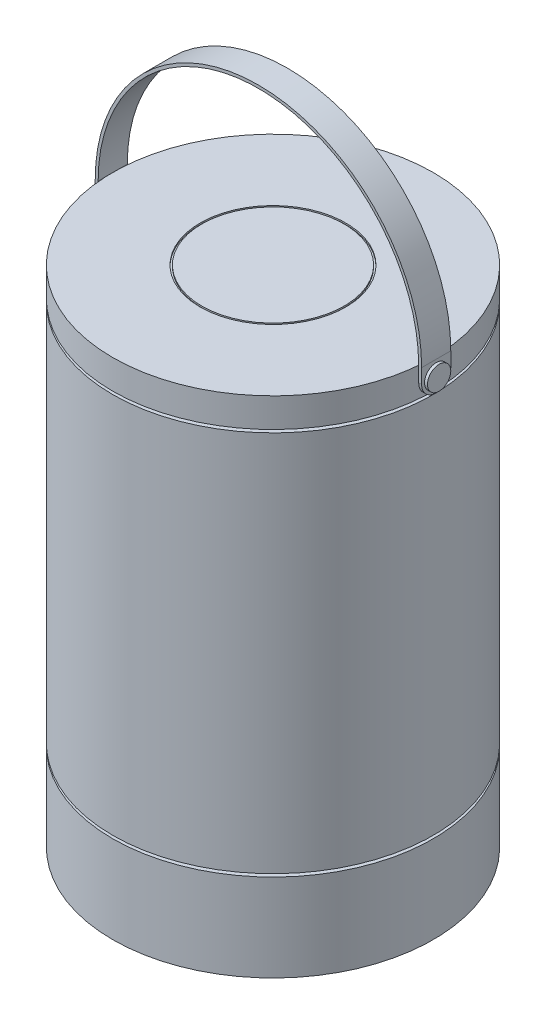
ISO-10303-21;
HEADER;
FILE_DESCRIPTION(('STEP AP214'),'2;1');
FILE_NAME('part.step','',(''),(''),'','','');
FILE_SCHEMA(('AUTOMOTIVE_DESIGN { 1 0 10303 214 1 1 1 1 }'));
ENDSEC;
DATA;
#1=APPLICATION_CONTEXT('core data for automotive mechanical design processes');
#2=APPLICATION_PROTOCOL_DEFINITION('international standard','automotive_design',2000,#1);
#3=PRODUCT_CONTEXT('',#1,'mechanical');
#4=PRODUCT('Part','Part','',(#3));
#5=PRODUCT_RELATED_PRODUCT_CATEGORY('part','',(#4));
#6=PRODUCT_DEFINITION_FORMATION('','',#4);
#7=PRODUCT_DEFINITION_CONTEXT('part definition',#1,'design');
#8=PRODUCT_DEFINITION('design','',#6,#7);
#9=PRODUCT_DEFINITION_SHAPE('','',#8);
#10=(LENGTH_UNIT() NAMED_UNIT(*) SI_UNIT(.MILLI.,.METRE.));
#11=(NAMED_UNIT(*) PLANE_ANGLE_UNIT() SI_UNIT($,.RADIAN.));
#12=(NAMED_UNIT(*) SI_UNIT($,.STERADIAN.) SOLID_ANGLE_UNIT());
#13=UNCERTAINTY_MEASURE_WITH_UNIT(LENGTH_MEASURE(1.E-05),#10,'distance_accuracy_value','');
#14=(GEOMETRIC_REPRESENTATION_CONTEXT(3) GLOBAL_UNCERTAINTY_ASSIGNED_CONTEXT((#13)) GLOBAL_UNIT_ASSIGNED_CONTEXT((#10,
#11,#12)) REPRESENTATION_CONTEXT('',''));
#15=CARTESIAN_POINT('',(0.,0.,0.));
#16=DIRECTION('',(0.,0.,1.));
#17=DIRECTION('',(1.,0.,0.));
#18=AXIS2_PLACEMENT_3D('',#15,#16,#17);
#19=CARTESIAN_POINT('',(55.,168.,0.));
#20=DIRECTION('',(1.,0.,0.));
#21=DIRECTION('',(0.,0.,-1.));
#22=AXIS2_PLACEMENT_3D('',#19,#20,#21);
#23=CYLINDRICAL_SURFACE('',#22,5.);
#24=DIRECTION('',(1.,0.,0.));
#25=VECTOR('',#24,1.);
#26=CARTESIAN_POINT('',(0.,168.,5.));
#27=LINE('',#26,#25);
#28=CARTESIAN_POINT('',(55.,168.,5.));
#29=VERTEX_POINT('',#28);
#30=CARTESIAN_POINT('',(56.,168.,5.));
#31=VERTEX_POINT('',#30);
#32=EDGE_CURVE('E183',#29,#31,#27,.T.);
#33=ORIENTED_EDGE('',*,*,#32,.F.);
#34=CARTESIAN_POINT('',(55.,168.,0.));
#35=DIRECTION('',(-1.,0.,0.));
#36=DIRECTION('',(0.,0.,1.));
#37=AXIS2_PLACEMENT_3D('',#34,#35,#36);
#38=CIRCLE('',#37,5.);
#39=CARTESIAN_POINT('',(55.,168.,-5.));
#40=VERTEX_POINT('',#39);
#41=EDGE_CURVE('E66',#40,#29,#38,.T.);
#42=ORIENTED_EDGE('',*,*,#41,.F.);
#43=DIRECTION('',(-1.,0.,0.));
#44=VECTOR('',#43,1.);
#45=CARTESIAN_POINT('',(55.,168.,-5.));
#46=LINE('',#45,#44);
#47=CARTESIAN_POINT('',(56.,168.,-5.));
#48=VERTEX_POINT('',#47);
#49=EDGE_CURVE('E185',#48,#40,#46,.T.);
#50=ORIENTED_EDGE('',*,*,#49,.F.);
#51=CARTESIAN_POINT('',(56.,168.,0.));
#52=DIRECTION('',(1.,0.,0.));
#53=DIRECTION('',(0.,0.,-1.));
#54=AXIS2_PLACEMENT_3D('',#51,#52,#53);
#55=CIRCLE('',#54,5.);
#56=EDGE_CURVE('E59',#31,#48,#55,.T.);
#57=ORIENTED_EDGE('',*,*,#56,.F.);
#58=EDGE_LOOP('',(#33,#42,#50,#57));
#59=FACE_BOUND('',#58,.T.);
#60=ADVANCED_FACE('F51',(#59),#23,.T.);
#61=CARTESIAN_POINT('',(-55.,168.,0.));
#62=DIRECTION('',(1.,0.,0.));
#63=DIRECTION('',(0.,0.,-1.));
#64=AXIS2_PLACEMENT_3D('',#61,#62,#63);
#65=CYLINDRICAL_SURFACE('',#64,5.);
#66=DIRECTION('',(-1.,0.,0.));
#67=VECTOR('',#66,1.);
#68=CARTESIAN_POINT('',(-55.,168.,-5.));
#69=LINE('',#68,#67);
#70=CARTESIAN_POINT('',(-55.,168.,-5.));
#71=VERTEX_POINT('',#70);
#72=CARTESIAN_POINT('',(-56.,168.,-5.));
#73=VERTEX_POINT('',#72);
#74=EDGE_CURVE('E171',#71,#73,#69,.T.);
#75=ORIENTED_EDGE('',*,*,#74,.F.);
#76=CARTESIAN_POINT('',(-55.,168.,0.));
#77=DIRECTION('',(1.,0.,0.));
#78=DIRECTION('',(0.,0.,-1.));
#79=AXIS2_PLACEMENT_3D('',#76,#77,#78);
#80=CIRCLE('',#79,5.);
#81=CARTESIAN_POINT('',(-55.,168.,5.));
#82=VERTEX_POINT('',#81);
#83=EDGE_CURVE('E180',#82,#71,#80,.T.);
#84=ORIENTED_EDGE('',*,*,#83,.F.);
#85=DIRECTION('',(1.,0.,0.));
#86=VECTOR('',#85,1.);
#87=CARTESIAN_POINT('',(0.,168.,5.));
#88=LINE('',#87,#86);
#89=CARTESIAN_POINT('',(-56.,168.,5.));
#90=VERTEX_POINT('',#89);
#91=EDGE_CURVE('E178',#90,#82,#88,.T.);
#92=ORIENTED_EDGE('',*,*,#91,.F.);
#93=CARTESIAN_POINT('',(-56.,168.,0.));
#94=DIRECTION('',(-1.,0.,0.));
#95=DIRECTION('',(0.,0.,1.));
#96=AXIS2_PLACEMENT_3D('',#93,#94,#95);
#97=CIRCLE('',#96,5.);
#98=EDGE_CURVE('E132',#73,#90,#97,.T.);
#99=ORIENTED_EDGE('',*,*,#98,.F.);
#100=EDGE_LOOP('',(#75,#84,#92,#99));
#101=FACE_BOUND('',#100,.T.);
#102=ADVANCED_FACE('F210',(#101),#65,.T.);
#103=CARTESIAN_POINT('',(0.,173.,-5.));
#104=DIRECTION('',(0.,0.,1.));
#105=DIRECTION('',(1.,0.,0.));
#106=AXIS2_PLACEMENT_3D('',#103,#104,#105);
#107=CYLINDRICAL_SURFACE('',#106,56.);
#108=DIRECTION('',(0.,0.,1.));
#109=VECTOR('',#108,1.);
#110=CARTESIAN_POINT('',(-56.,173.,-5.));
#111=LINE('',#110,#109);
#112=CARTESIAN_POINT('',(-56.,173.,-5.));
#113=VERTEX_POINT('',#112);
#114=CARTESIAN_POINT('',(-56.,173.,5.));
#115=VERTEX_POINT('',#114);
#116=EDGE_CURVE('E115',#113,#115,#111,.T.);
#117=ORIENTED_EDGE('',*,*,#116,.T.);
#118=CARTESIAN_POINT('',(0.,173.,5.));
#119=DIRECTION('',(0.,0.,1.));
#120=DIRECTION('',(1.,0.,0.));
#121=AXIS2_PLACEMENT_3D('',#118,#119,#120);
#122=CIRCLE('',#121,56.);
#123=CARTESIAN_POINT('',(56.,173.,5.));
#124=VERTEX_POINT('',#123);
#125=EDGE_CURVE('E120',#124,#115,#122,.T.);
#126=ORIENTED_EDGE('',*,*,#125,.F.);
#127=DIRECTION('',(0.,0.,1.));
#128=VECTOR('',#127,1.);
#129=CARTESIAN_POINT('',(56.,173.,-5.));
#130=LINE('',#129,#128);
#131=CARTESIAN_POINT('',(56.,173.,-5.));
#132=VERTEX_POINT('',#131);
#133=EDGE_CURVE('E169',#132,#124,#130,.T.);
#134=ORIENTED_EDGE('',*,*,#133,.F.);
#135=CARTESIAN_POINT('',(0.,173.,-5.));
#136=DIRECTION('',(0.,0.,1.));
#137=DIRECTION('',(1.,0.,0.));
#138=AXIS2_PLACEMENT_3D('',#135,#136,#137);
#139=CIRCLE('',#138,56.);
#140=EDGE_CURVE('E122',#132,#113,#139,.T.);
#141=ORIENTED_EDGE('',*,*,#140,.T.);
#142=EDGE_LOOP('',(#117,#126,#134,#141));
#143=FACE_BOUND('',#142,.T.);
#144=ADVANCED_FACE('F117',(#143),#107,.T.);
#145=CARTESIAN_POINT('',(56.,173.,-5.));
#146=DIRECTION('',(1.,0.,0.));
#147=DIRECTION('',(0.,0.,-1.));
#148=AXIS2_PLACEMENT_3D('',#145,#146,#147);
#149=PLANE('',#148);
#150=CARTESIAN_POINT('',(56.,168.,0.));
#151=DIRECTION('',(1.,0.,0.));
#152=DIRECTION('',(0.,0.,-1.));
#153=AXIS2_PLACEMENT_3D('',#150,#151,#152);
#154=CIRCLE('',#153,4.);
#155=CARTESIAN_POINT('',(56.,168.,-4.));
#156=VERTEX_POINT('',#155);
#157=EDGE_CURVE('E146',#156,#156,#154,.T.);
#158=ORIENTED_EDGE('',*,*,#157,.F.);
#159=EDGE_LOOP('',(#158));
#160=FACE_BOUND('',#159,.T.);
#161=DIRECTION('',(0.,1.,0.));
#162=VECTOR('',#161,1.);
#163=CARTESIAN_POINT('',(56.,173.,5.));
#164=LINE('',#163,#162);
#165=EDGE_CURVE('E141',#31,#124,#164,.T.);
#166=ORIENTED_EDGE('',*,*,#165,.F.);
#167=ORIENTED_EDGE('',*,*,#56,.T.);
#168=DIRECTION('',(0.,1.,0.));
#169=VECTOR('',#168,1.);
#170=CARTESIAN_POINT('',(56.,173.,-5.));
#171=LINE('',#170,#169);
#172=EDGE_CURVE('E127',#48,#132,#171,.T.);
#173=ORIENTED_EDGE('',*,*,#172,.T.);
#174=ORIENTED_EDGE('',*,*,#133,.T.);
#175=EDGE_LOOP('',(#166,#167,#173,#174));
#176=FACE_BOUND('',#175,.T.);
#177=ADVANCED_FACE('F201',(#160,#176),#149,.T.);
#178=CARTESIAN_POINT('',(55.,173.,-5.));
#179=DIRECTION('',(-1.,0.,0.));
#180=DIRECTION('',(0.,0.,1.));
#181=AXIS2_PLACEMENT_3D('',#178,#179,#180);
#182=PLANE('',#181);
#183=DIRECTION('',(0.,-1.,0.));
#184=VECTOR('',#183,1.);
#185=CARTESIAN_POINT('',(55.,173.,-5.));
#186=LINE('',#185,#184);
#187=CARTESIAN_POINT('',(55.,173.,-5.));
#188=VERTEX_POINT('',#187);
#189=EDGE_CURVE('E165',#188,#40,#186,.T.);
#190=ORIENTED_EDGE('',*,*,#189,.T.);
#191=ORIENTED_EDGE('',*,*,#41,.T.);
#192=DIRECTION('',(0.,-1.,0.));
#193=VECTOR('',#192,1.);
#194=CARTESIAN_POINT('',(55.,173.,5.));
#195=LINE('',#194,#193);
#196=CARTESIAN_POINT('',(55.,173.,5.));
#197=VERTEX_POINT('',#196);
#198=EDGE_CURVE('E154',#197,#29,#195,.T.);
#199=ORIENTED_EDGE('',*,*,#198,.F.);
#200=DIRECTION('',(0.,0.,1.));
#201=VECTOR('',#200,1.);
#202=CARTESIAN_POINT('',(55.,173.,-5.));
#203=LINE('',#202,#201);
#204=EDGE_CURVE('E172',#188,#197,#203,.T.);
#205=ORIENTED_EDGE('',*,*,#204,.F.);
#206=EDGE_LOOP('',(#190,#191,#199,#205));
#207=FACE_BOUND('',#206,.T.);
#208=ADVANCED_FACE('F189',(#207),#182,.T.);
#209=CARTESIAN_POINT('',(0.,173.,-5.));
#210=DIRECTION('',(0.,0.,1.));
#211=DIRECTION('',(1.,0.,0.));
#212=AXIS2_PLACEMENT_3D('',#209,#210,#211);
#213=CYLINDRICAL_SURFACE('',#212,55.);
#214=ORIENTED_EDGE('',*,*,#204,.T.);
#215=CARTESIAN_POINT('',(0.,173.,5.));
#216=DIRECTION('',(0.,0.,-1.));
#217=DIRECTION('',(1.,0.,0.));
#218=AXIS2_PLACEMENT_3D('',#215,#216,#217);
#219=CIRCLE('',#218,55.);
#220=CARTESIAN_POINT('',(-55.,173.,5.));
#221=VERTEX_POINT('',#220);
#222=EDGE_CURVE('E151',#221,#197,#219,.T.);
#223=ORIENTED_EDGE('',*,*,#222,.F.);
#224=DIRECTION('',(0.,0.,1.));
#225=VECTOR('',#224,1.);
#226=CARTESIAN_POINT('',(-55.,173.,-5.));
#227=LINE('',#226,#225);
#228=CARTESIAN_POINT('',(-55.,173.,-5.));
#229=VERTEX_POINT('',#228);
#230=EDGE_CURVE('E126',#229,#221,#227,.T.);
#231=ORIENTED_EDGE('',*,*,#230,.F.);
#232=CARTESIAN_POINT('',(0.,173.,-5.));
#233=DIRECTION('',(0.,0.,-1.));
#234=DIRECTION('',(1.,0.,0.));
#235=AXIS2_PLACEMENT_3D('',#232,#233,#234);
#236=CIRCLE('',#235,55.);
#237=EDGE_CURVE('E162',#229,#188,#236,.T.);
#238=ORIENTED_EDGE('',*,*,#237,.T.);
#239=EDGE_LOOP('',(#214,#223,#231,#238));
#240=FACE_BOUND('',#239,.T.);
#241=ADVANCED_FACE('F195',(#240),#213,.F.);
#242=CARTESIAN_POINT('',(-55.,173.,-5.));
#243=DIRECTION('',(1.,0.,0.));
#244=DIRECTION('',(0.,0.,-1.));
#245=AXIS2_PLACEMENT_3D('',#242,#243,#244);
#246=PLANE('',#245);
#247=DIRECTION('',(0.,1.,0.));
#248=VECTOR('',#247,1.);
#249=CARTESIAN_POINT('',(-55.,173.,5.));
#250=LINE('',#249,#248);
#251=EDGE_CURVE('E136',#82,#221,#250,.T.);
#252=ORIENTED_EDGE('',*,*,#251,.F.);
#253=ORIENTED_EDGE('',*,*,#83,.T.);
#254=DIRECTION('',(0.,1.,0.));
#255=VECTOR('',#254,1.);
#256=CARTESIAN_POINT('',(-55.,173.,-5.));
#257=LINE('',#256,#255);
#258=EDGE_CURVE('E160',#71,#229,#257,.T.);
#259=ORIENTED_EDGE('',*,*,#258,.T.);
#260=ORIENTED_EDGE('',*,*,#230,.T.);
#261=EDGE_LOOP('',(#252,#253,#259,#260));
#262=FACE_BOUND('',#261,.T.);
#263=ADVANCED_FACE('F228',(#262),#246,.T.);
#264=CARTESIAN_POINT('',(-56.,173.,-5.));
#265=DIRECTION('',(-1.,0.,0.));
#266=DIRECTION('',(0.,0.,1.));
#267=AXIS2_PLACEMENT_3D('',#264,#265,#266);
#268=PLANE('',#267);
#269=CARTESIAN_POINT('',(-56.,168.,0.));
#270=DIRECTION('',(-1.,0.,0.));
#271=DIRECTION('',(0.,0.,1.));
#272=AXIS2_PLACEMENT_3D('',#269,#270,#271);
#273=CIRCLE('',#272,4.);
#274=CARTESIAN_POINT('',(-56.,168.,4.));
#275=VERTEX_POINT('',#274);
#276=EDGE_CURVE('E12',#275,#275,#273,.T.);
#277=ORIENTED_EDGE('',*,*,#276,.F.);
#278=EDGE_LOOP('',(#277));
#279=FACE_BOUND('',#278,.T.);
#280=DIRECTION('',(0.,-1.,0.));
#281=VECTOR('',#280,1.);
#282=CARTESIAN_POINT('',(-56.,173.,-5.));
#283=LINE('',#282,#281);
#284=EDGE_CURVE('E158',#113,#73,#283,.T.);
#285=ORIENTED_EDGE('',*,*,#284,.T.);
#286=ORIENTED_EDGE('',*,*,#98,.T.);
#287=DIRECTION('',(0.,-1.,0.));
#288=VECTOR('',#287,1.);
#289=CARTESIAN_POINT('',(-56.,173.,5.));
#290=LINE('',#289,#288);
#291=EDGE_CURVE('E130',#115,#90,#290,.T.);
#292=ORIENTED_EDGE('',*,*,#291,.F.);
#293=ORIENTED_EDGE('',*,*,#116,.F.);
#294=EDGE_LOOP('',(#285,#286,#292,#293));
#295=FACE_BOUND('',#294,.T.);
#296=ADVANCED_FACE('F131',(#279,#295),#268,.T.);
#297=CARTESIAN_POINT('',(0.,173.,-5.));
#298=DIRECTION('',(0.,0.,1.));
#299=DIRECTION('',(1.,0.,0.));
#300=AXIS2_PLACEMENT_3D('',#297,#298,#299);
#301=PLANE('',#300);
#302=ORIENTED_EDGE('',*,*,#172,.F.);
#303=ORIENTED_EDGE('',*,*,#49,.T.);
#304=ORIENTED_EDGE('',*,*,#189,.F.);
#305=ORIENTED_EDGE('',*,*,#237,.F.);
#306=ORIENTED_EDGE('',*,*,#258,.F.);
#307=ORIENTED_EDGE('',*,*,#74,.T.);
#308=ORIENTED_EDGE('',*,*,#284,.F.);
#309=ORIENTED_EDGE('',*,*,#140,.F.);
#310=EDGE_LOOP('',(#302,#303,#304,#305,#306,#307,#308,#309));
#311=FACE_BOUND('',#310,.T.);
#312=ADVANCED_FACE('F199',(#311),#301,.F.);
#313=CARTESIAN_POINT('',(0.,173.,5.));
#314=DIRECTION('',(0.,0.,1.));
#315=DIRECTION('',(1.,0.,0.));
#316=AXIS2_PLACEMENT_3D('',#313,#314,#315);
#317=PLANE('',#316);
#318=ORIENTED_EDGE('',*,*,#198,.T.);
#319=ORIENTED_EDGE('',*,*,#32,.T.);
#320=ORIENTED_EDGE('',*,*,#165,.T.);
#321=ORIENTED_EDGE('',*,*,#125,.T.);
#322=ORIENTED_EDGE('',*,*,#291,.T.);
#323=ORIENTED_EDGE('',*,*,#91,.T.);
#324=ORIENTED_EDGE('',*,*,#251,.T.);
#325=ORIENTED_EDGE('',*,*,#222,.T.);
#326=EDGE_LOOP('',(#318,#319,#320,#321,#322,#323,#324,#325));
#327=FACE_BOUND('',#326,.T.);
#328=ADVANCED_FACE('F139',(#327),#317,.T.);
#329=CARTESIAN_POINT('',(57.,168.,0.));
#330=DIRECTION('',(-1.,0.,0.));
#331=DIRECTION('',(0.,0.,1.));
#332=AXIS2_PLACEMENT_3D('',#329,#330,#331);
#333=CYLINDRICAL_SURFACE('',#332,4.);
#334=CARTESIAN_POINT('',(57.,168.,0.));
#335=DIRECTION('',(1.,0.,0.));
#336=DIRECTION('',(0.,0.,-1.));
#337=AXIS2_PLACEMENT_3D('',#334,#335,#336);
#338=CIRCLE('',#337,4.);
#339=CARTESIAN_POINT('',(57.,168.,-4.));
#340=VERTEX_POINT('',#339);
#341=EDGE_CURVE('E143',#340,#340,#338,.T.);
#342=ORIENTED_EDGE('',*,*,#341,.F.);
#343=EDGE_LOOP('',(#342));
#344=FACE_BOUND('',#343,.T.);
#345=ORIENTED_EDGE('',*,*,#157,.T.);
#346=EDGE_LOOP('',(#345));
#347=FACE_BOUND('',#346,.T.);
#348=ADVANCED_FACE('F260',(#344,#347),#333,.T.);
#349=CARTESIAN_POINT('',(57.,168.,0.));
#350=DIRECTION('',(1.,0.,0.));
#351=DIRECTION('',(0.,0.,-1.));
#352=AXIS2_PLACEMENT_3D('',#349,#350,#351);
#353=PLANE('',#352);
#354=ORIENTED_EDGE('',*,*,#341,.T.);
#355=EDGE_LOOP('',(#354));
#356=FACE_BOUND('',#355,.T.);
#357=ADVANCED_FACE('F267',(#356),#353,.T.);
#358=CARTESIAN_POINT('',(-57.,168.,0.));
#359=DIRECTION('',(1.,0.,0.));
#360=DIRECTION('',(0.,0.,-1.));
#361=AXIS2_PLACEMENT_3D('',#358,#359,#360);
#362=CYLINDRICAL_SURFACE('',#361,4.);
#363=CARTESIAN_POINT('',(-57.,168.,0.));
#364=DIRECTION('',(1.,0.,0.));
#365=DIRECTION('',(0.,0.,-1.));
#366=AXIS2_PLACEMENT_3D('',#363,#364,#365);
#367=CIRCLE('',#366,4.);
#368=CARTESIAN_POINT('',(-57.,168.,-4.));
#369=VERTEX_POINT('',#368);
#370=EDGE_CURVE('E333',#369,#369,#367,.T.);
#371=ORIENTED_EDGE('',*,*,#370,.T.);
#372=EDGE_LOOP('',(#371));
#373=FACE_BOUND('',#372,.T.);
#374=ORIENTED_EDGE('',*,*,#276,.T.);
#375=EDGE_LOOP('',(#374));
#376=FACE_BOUND('',#375,.T.);
#377=ADVANCED_FACE('F274',(#373,#376),#362,.T.);
#378=CARTESIAN_POINT('',(-57.,168.,0.));
#379=DIRECTION('',(-1.,0.,0.));
#380=DIRECTION('',(0.,0.,-1.));
#381=AXIS2_PLACEMENT_3D('',#378,#379,#380);
#382=PLANE('',#381);
#383=ORIENTED_EDGE('',*,*,#370,.F.);
#384=EDGE_LOOP('',(#383));
#385=FACE_BOUND('',#384,.T.);
#386=ADVANCED_FACE('F281',(#385),#382,.T.);
#387=CLOSED_SHELL('',(#60,#102,#144,#177,#208,#241,#263,#296,#312,#328,#348,#357,#377,#386));
#388=MANIFOLD_SOLID_BREP('B2',#387);
#389=CARTESIAN_POINT('',(0.,173.,0.));
#390=DIRECTION('',(0.,-1.,0.));
#391=DIRECTION('',(0.,0.,-1.));
#392=AXIS2_PLACEMENT_3D('',#389,#390,#391);
#393=CYLINDRICAL_SURFACE('',#392,55.);
#394=CARTESIAN_POINT('',(0.,31.,0.));
#395=DIRECTION('',(0.,-1.,0.));
#396=DIRECTION('',(0.,0.,-1.));
#397=AXIS2_PLACEMENT_3D('',#394,#395,#396);
#398=CIRCLE('',#397,55.);
#399=CARTESIAN_POINT('',(0.,31.,-55.));
#400=VERTEX_POINT('',#399);
#401=EDGE_CURVE('E358',#400,#400,#398,.T.);
#402=ORIENTED_EDGE('',*,*,#401,.F.);
#403=EDGE_LOOP('',(#402));
#404=FACE_BOUND('',#403,.T.);
#405=CARTESIAN_POINT('',(0.,162.,0.));
#406=DIRECTION('',(0.,1.,0.));
#407=DIRECTION('',(0.,0.,1.));
#408=AXIS2_PLACEMENT_3D('',#405,#406,#407);
#409=CIRCLE('',#408,55.);
#410=CARTESIAN_POINT('',(0.,162.,55.));
#411=VERTEX_POINT('',#410);
#412=EDGE_CURVE('E372',#411,#411,#409,.T.);
#413=ORIENTED_EDGE('',*,*,#412,.F.);
#414=EDGE_LOOP('',(#413));
#415=FACE_BOUND('',#414,.T.);
#416=ADVANCED_FACE('F345',(#404,#415),#393,.T.);
#417=CARTESIAN_POINT('',(0.,31.,0.));
#418=DIRECTION('',(0.,-1.,0.));
#419=DIRECTION('',(0.,0.,-1.));
#420=AXIS2_PLACEMENT_3D('',#417,#418,#419);
#421=PLANE('',#420);
#422=CARTESIAN_POINT('',(0.,31.,0.));
#423=DIRECTION('',(0.,-1.,0.));
#424=DIRECTION('',(0.,0.,-1.));
#425=AXIS2_PLACEMENT_3D('',#422,#423,#424);
#426=CIRCLE('',#425,40.);
#427=CARTESIAN_POINT('',(0.,31.,-40.));
#428=VERTEX_POINT('',#427);
#429=EDGE_CURVE('E364',#428,#428,#426,.T.);
#430=ORIENTED_EDGE('',*,*,#429,.F.);
#431=EDGE_LOOP('',(#430));
#432=FACE_BOUND('',#431,.T.);
#433=ORIENTED_EDGE('',*,*,#401,.T.);
#434=EDGE_LOOP('',(#433));
#435=FACE_BOUND('',#434,.T.);
#436=ADVANCED_FACE('F441',(#432,#435),#421,.T.);
#437=CARTESIAN_POINT('',(0.,30.,0.));
#438=DIRECTION('',(0.,-1.,0.));
#439=DIRECTION('',(0.,0.,-1.));
#440=AXIS2_PLACEMENT_3D('',#437,#438,#439);
#441=PLANE('',#440);
#442=CARTESIAN_POINT('',(0.,30.,0.));
#443=DIRECTION('',(0.,-1.,0.));
#444=DIRECTION('',(0.,0.,-1.));
#445=AXIS2_PLACEMENT_3D('',#442,#443,#444);
#446=CIRCLE('',#445,40.);
#447=CARTESIAN_POINT('',(0.,30.,-40.));
#448=VERTEX_POINT('',#447);
#449=EDGE_CURVE('E368',#448,#448,#446,.T.);
#450=ORIENTED_EDGE('',*,*,#449,.T.);
#451=EDGE_LOOP('',(#450));
#452=FACE_BOUND('',#451,.T.);
#453=CARTESIAN_POINT('',(0.,30.,0.));
#454=DIRECTION('',(0.,-1.,0.));
#455=DIRECTION('',(0.,0.,-1.));
#456=AXIS2_PLACEMENT_3D('',#453,#454,#455);
#457=CIRCLE('',#456,55.);
#458=CARTESIAN_POINT('',(0.,30.,-55.));
#459=VERTEX_POINT('',#458);
#460=EDGE_CURVE('E360',#459,#459,#457,.T.);
#461=ORIENTED_EDGE('',*,*,#460,.F.);
#462=EDGE_LOOP('',(#461));
#463=FACE_BOUND('',#462,.T.);
#464=ADVANCED_FACE('F446',(#452,#463),#441,.F.);
#465=CARTESIAN_POINT('',(0.,31.,0.));
#466=DIRECTION('',(0.,-1.,0.));
#467=DIRECTION('',(0.,0.,-1.));
#468=AXIS2_PLACEMENT_3D('',#465,#466,#467);
#469=CYLINDRICAL_SURFACE('',#468,40.);
#470=ORIENTED_EDGE('',*,*,#429,.T.);
#471=EDGE_LOOP('',(#470));
#472=FACE_BOUND('',#471,.T.);
#473=ORIENTED_EDGE('',*,*,#449,.F.);
#474=EDGE_LOOP('',(#473));
#475=FACE_BOUND('',#474,.T.);
#476=ADVANCED_FACE('F461',(#472,#475),#469,.T.);
#477=CARTESIAN_POINT('',(0.,0.,0.));
#478=DIRECTION('',(0.,1.,0.));
#479=DIRECTION('',(0.,0.,1.));
#480=AXIS2_PLACEMENT_3D('',#477,#478,#479);
#481=PLANE('',#480);
#482=CARTESIAN_POINT('',(0.,0.,0.));
#483=DIRECTION('',(0.,1.,0.));
#484=DIRECTION('',(0.,0.,1.));
#485=AXIS2_PLACEMENT_3D('',#482,#483,#484);
#486=CIRCLE('',#485,55.);
#487=CARTESIAN_POINT('',(0.,0.,55.));
#488=VERTEX_POINT('',#487);
#489=EDGE_CURVE('E349',#488,#488,#486,.T.);
#490=ORIENTED_EDGE('',*,*,#489,.F.);
#491=EDGE_LOOP('',(#490));
#492=FACE_BOUND('',#491,.T.);
#493=ADVANCED_FACE('F453',(#492),#481,.F.);
#494=ORIENTED_EDGE('',*,*,#460,.T.);
#495=EDGE_LOOP('',(#494));
#496=FACE_BOUND('',#495,.T.);
#497=ORIENTED_EDGE('',*,*,#489,.T.);
#498=EDGE_LOOP('',(#497));
#499=FACE_BOUND('',#498,.T.);
#500=ADVANCED_FACE('F347',(#496,#499),#393,.T.);
#501=CARTESIAN_POINT('',(0.,162.,0.));
#502=DIRECTION('',(0.,1.,0.));
#503=DIRECTION('',(0.,0.,1.));
#504=AXIS2_PLACEMENT_3D('',#501,#502,#503);
#505=PLANE('',#504);
#506=CARTESIAN_POINT('',(0.,162.,0.));
#507=DIRECTION('',(0.,1.,0.));
#508=DIRECTION('',(0.,0.,1.));
#509=AXIS2_PLACEMENT_3D('',#506,#507,#508);
#510=CIRCLE('',#509,40.);
#511=CARTESIAN_POINT('',(0.,162.,40.));
#512=VERTEX_POINT('',#511);
#513=EDGE_CURVE('E380',#512,#512,#510,.T.);
#514=ORIENTED_EDGE('',*,*,#513,.F.);
#515=EDGE_LOOP('',(#514));
#516=FACE_BOUND('',#515,.T.);
#517=ORIENTED_EDGE('',*,*,#412,.T.);
#518=EDGE_LOOP('',(#517));
#519=FACE_BOUND('',#518,.T.);
#520=ADVANCED_FACE('F452',(#516,#519),#505,.T.);
#521=CARTESIAN_POINT('',(0.,163.,0.));
#522=DIRECTION('',(0.,1.,0.));
#523=DIRECTION('',(0.,0.,1.));
#524=AXIS2_PLACEMENT_3D('',#521,#522,#523);
#525=PLANE('',#524);
#526=CARTESIAN_POINT('',(0.,163.,0.));
#527=DIRECTION('',(0.,1.,0.));
#528=DIRECTION('',(0.,0.,1.));
#529=AXIS2_PLACEMENT_3D('',#526,#527,#528);
#530=CIRCLE('',#529,40.);
#531=CARTESIAN_POINT('',(0.,163.,40.));
#532=VERTEX_POINT('',#531);
#533=EDGE_CURVE('E384',#532,#532,#530,.T.);
#534=ORIENTED_EDGE('',*,*,#533,.T.);
#535=EDGE_LOOP('',(#534));
#536=FACE_BOUND('',#535,.T.);
#537=CARTESIAN_POINT('',(0.,163.,0.));
#538=DIRECTION('',(0.,1.,0.));
#539=DIRECTION('',(0.,0.,1.));
#540=AXIS2_PLACEMENT_3D('',#537,#538,#539);
#541=CIRCLE('',#540,55.);
#542=CARTESIAN_POINT('',(0.,163.,55.));
#543=VERTEX_POINT('',#542);
#544=EDGE_CURVE('E376',#543,#543,#541,.T.);
#545=ORIENTED_EDGE('',*,*,#544,.F.);
#546=EDGE_LOOP('',(#545));
#547=FACE_BOUND('',#546,.T.);
#548=ADVANCED_FACE('F434',(#536,#547),#525,.F.);
#549=CARTESIAN_POINT('',(0.,162.,0.));
#550=DIRECTION('',(0.,1.,0.));
#551=DIRECTION('',(0.,0.,1.));
#552=AXIS2_PLACEMENT_3D('',#549,#550,#551);
#553=CYLINDRICAL_SURFACE('',#552,40.);
#554=ORIENTED_EDGE('',*,*,#513,.T.);
#555=EDGE_LOOP('',(#554));
#556=FACE_BOUND('',#555,.T.);
#557=ORIENTED_EDGE('',*,*,#533,.F.);
#558=EDGE_LOOP('',(#557));
#559=FACE_BOUND('',#558,.T.);
#560=ADVANCED_FACE('F426',(#556,#559),#553,.T.);
#561=CARTESIAN_POINT('',(0.,173.,0.));
#562=DIRECTION('',(0.,1.,0.));
#563=DIRECTION('',(0.,0.,1.));
#564=AXIS2_PLACEMENT_3D('',#561,#562,#563);
#565=PLANE('',#564);
#566=CARTESIAN_POINT('',(0.,173.,0.));
#567=DIRECTION('',(0.,1.,0.));
#568=DIRECTION('',(0.,0.,1.));
#569=AXIS2_PLACEMENT_3D('',#566,#567,#568);
#570=CIRCLE('',#569,25.);
#571=CARTESIAN_POINT('',(0.,173.,25.));
#572=VERTEX_POINT('',#571);
#573=EDGE_CURVE('E392',#572,#572,#570,.T.);
#574=ORIENTED_EDGE('',*,*,#573,.F.);
#575=EDGE_LOOP('',(#574));
#576=FACE_BOUND('',#575,.T.);
#577=CARTESIAN_POINT('',(0.,173.,0.));
#578=DIRECTION('',(0.,1.,0.));
#579=DIRECTION('',(0.,0.,1.));
#580=AXIS2_PLACEMENT_3D('',#577,#578,#579);
#581=CIRCLE('',#580,55.);
#582=CARTESIAN_POINT('',(0.,173.,55.));
#583=VERTEX_POINT('',#582);
#584=EDGE_CURVE('E50',#583,#583,#581,.T.);
#585=ORIENTED_EDGE('',*,*,#584,.T.);
#586=EDGE_LOOP('',(#585));
#587=FACE_BOUND('',#586,.T.);
#588=ADVANCED_FACE('F424',(#576,#587),#565,.T.);
#589=ORIENTED_EDGE('',*,*,#544,.T.);
#590=EDGE_LOOP('',(#589));
#591=FACE_BOUND('',#590,.T.);
#592=ORIENTED_EDGE('',*,*,#584,.F.);
#593=EDGE_LOOP('',(#592));
#594=FACE_BOUND('',#593,.T.);
#595=ADVANCED_FACE('F420',(#591,#594),#393,.T.);
#596=CARTESIAN_POINT('',(0.,172.5,0.));
#597=DIRECTION('',(0.,1.,0.));
#598=DIRECTION('',(0.,0.,1.));
#599=AXIS2_PLACEMENT_3D('',#596,#597,#598);
#600=CYLINDRICAL_SURFACE('',#599,25.);
#601=CARTESIAN_POINT('',(0.,172.5,0.));
#602=DIRECTION('',(0.,1.,0.));
#603=DIRECTION('',(0.,0.,1.));
#604=AXIS2_PLACEMENT_3D('',#601,#602,#603);
#605=CIRCLE('',#604,25.);
#606=CARTESIAN_POINT('',(0.,172.5,25.));
#607=VERTEX_POINT('',#606);
#608=EDGE_CURVE('E388',#607,#607,#605,.T.);
#609=ORIENTED_EDGE('',*,*,#608,.F.);
#610=EDGE_LOOP('',(#609));
#611=FACE_BOUND('',#610,.T.);
#612=ORIENTED_EDGE('',*,*,#573,.T.);
#613=EDGE_LOOP('',(#612));
#614=FACE_BOUND('',#613,.T.);
#615=ADVANCED_FACE('F414',(#611,#614),#600,.F.);
#616=CARTESIAN_POINT('',(0.,172.5,0.));
#617=DIRECTION('',(0.,1.,0.));
#618=DIRECTION('',(0.,0.,1.));
#619=AXIS2_PLACEMENT_3D('',#616,#617,#618);
#620=PLANE('',#619);
#621=CARTESIAN_POINT('',(0.,172.5,0.));
#622=DIRECTION('',(0.,1.,0.));
#623=DIRECTION('',(0.,0.,1.));
#624=AXIS2_PLACEMENT_3D('',#621,#622,#623);
#625=CIRCLE('',#624,24.42);
#626=CARTESIAN_POINT('',(0.,172.5,24.42));
#627=VERTEX_POINT('',#626);
#628=EDGE_CURVE('E396',#627,#627,#625,.T.);
#629=ORIENTED_EDGE('',*,*,#628,.F.);
#630=EDGE_LOOP('',(#629));
#631=FACE_BOUND('',#630,.T.);
#632=ORIENTED_EDGE('',*,*,#608,.T.);
#633=EDGE_LOOP('',(#632));
#634=FACE_BOUND('',#633,.T.);
#635=ADVANCED_FACE('F411',(#631,#634),#620,.T.);
#636=CARTESIAN_POINT('',(0.,172.5,0.));
#637=DIRECTION('',(0.,1.,0.));
#638=DIRECTION('',(0.,0.,1.));
#639=AXIS2_PLACEMENT_3D('',#636,#637,#638);
#640=CYLINDRICAL_SURFACE('',#639,24.42);
#641=ORIENTED_EDGE('',*,*,#628,.T.);
#642=EDGE_LOOP('',(#641));
#643=FACE_BOUND('',#642,.T.);
#644=CARTESIAN_POINT('',(0.,173.,0.));
#645=DIRECTION('',(0.,1.,0.));
#646=DIRECTION('',(0.,0.,1.));
#647=AXIS2_PLACEMENT_3D('',#644,#645,#646);
#648=CIRCLE('',#647,24.42);
#649=CARTESIAN_POINT('',(0.,173.,24.42));
#650=VERTEX_POINT('',#649);
#651=EDGE_CURVE('E400',#650,#650,#648,.T.);
#652=ORIENTED_EDGE('',*,*,#651,.F.);
#653=EDGE_LOOP('',(#652));
#654=FACE_BOUND('',#653,.T.);
#655=ADVANCED_FACE('F408',(#643,#654),#640,.T.);
#656=ORIENTED_EDGE('',*,*,#651,.T.);
#657=EDGE_LOOP('',(#656));
#658=FACE_BOUND('',#657,.T.);
#659=ADVANCED_FACE('F428',(#658),#565,.T.);
#660=CLOSED_SHELL('',(#416,#436,#464,#476,#493,#500,#520,#548,#560,#588,#595,#615,#635,#655,#659));
#661=MANIFOLD_SOLID_BREP('B6',#660);
#662=ADVANCED_BREP_SHAPE_REPRESENTATION('',(#18,#388,#661),#14);
#663=SHAPE_DEFINITION_REPRESENTATION(#9,#662);
ENDSEC;
END-ISO-10303-21;
